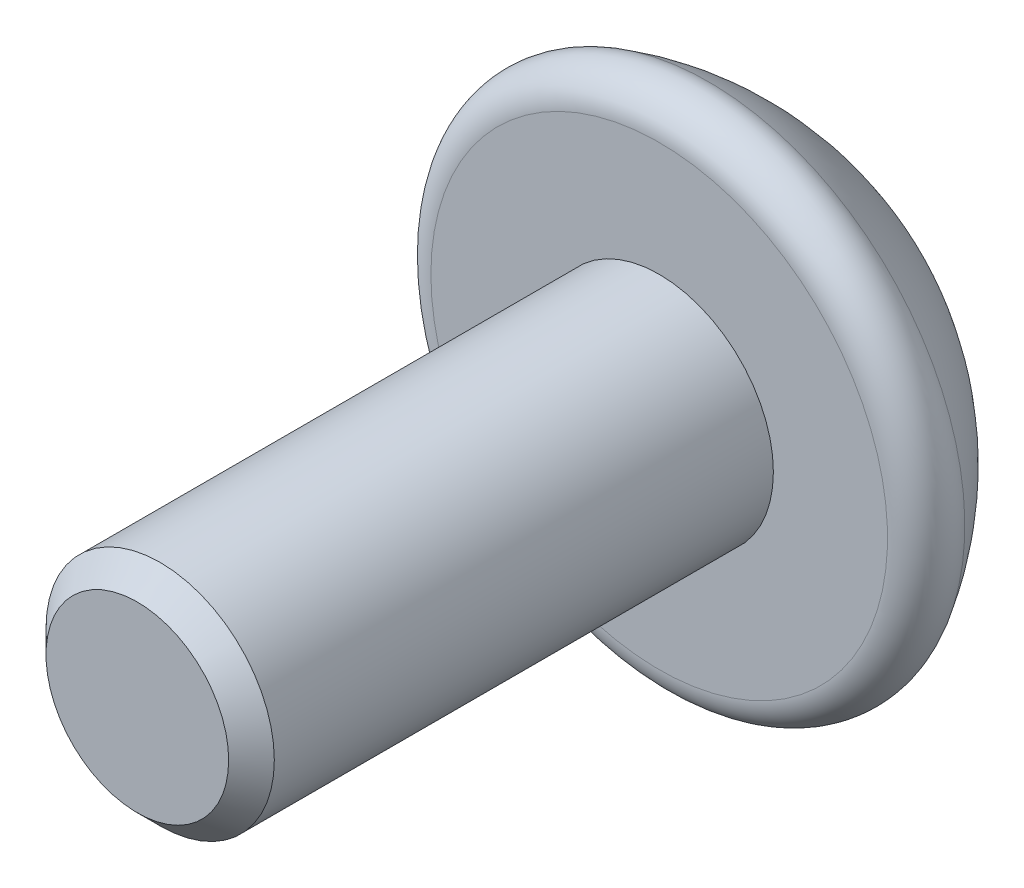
ISO-10303-21;
HEADER;
FILE_DESCRIPTION(('STEP AP214'),'2;1');
FILE_NAME('part.step','',(''),(''),'','','');
FILE_SCHEMA(('AUTOMOTIVE_DESIGN { 1 0 10303 214 1 1 1 1 }'));
ENDSEC;
DATA;
#1=APPLICATION_CONTEXT('core data for automotive mechanical design processes');
#2=APPLICATION_PROTOCOL_DEFINITION('international standard','automotive_design',2000,#1);
#3=PRODUCT_CONTEXT('',#1,'mechanical');
#4=PRODUCT('Part','Part','',(#3));
#5=PRODUCT_RELATED_PRODUCT_CATEGORY('part','',(#4));
#6=PRODUCT_DEFINITION_FORMATION('','',#4);
#7=PRODUCT_DEFINITION_CONTEXT('part definition',#1,'design');
#8=PRODUCT_DEFINITION('design','',#6,#7);
#9=PRODUCT_DEFINITION_SHAPE('','',#8);
#10=(LENGTH_UNIT() NAMED_UNIT(*) SI_UNIT(.MILLI.,.METRE.));
#11=(NAMED_UNIT(*) PLANE_ANGLE_UNIT() SI_UNIT($,.RADIAN.));
#12=(NAMED_UNIT(*) SI_UNIT($,.STERADIAN.) SOLID_ANGLE_UNIT());
#13=UNCERTAINTY_MEASURE_WITH_UNIT(LENGTH_MEASURE(1.E-05),#10,'distance_accuracy_value','');
#14=(GEOMETRIC_REPRESENTATION_CONTEXT(3) GLOBAL_UNCERTAINTY_ASSIGNED_CONTEXT((#13)) GLOBAL_UNIT_ASSIGNED_CONTEXT((#10,
#11,#12)) REPRESENTATION_CONTEXT('',''));
#15=CARTESIAN_POINT('',(0.,0.,0.));
#16=DIRECTION('',(0.,0.,1.));
#17=DIRECTION('',(1.,0.,0.));
#18=AXIS2_PLACEMENT_3D('',#15,#16,#17);
#19=CARTESIAN_POINT('',(0.,0.,1.5625));
#20=DIRECTION('',(0.,0.,-1.));
#21=DIRECTION('',(1.,0.,0.));
#22=AXIS2_PLACEMENT_3D('',#19,#20,#21);
#23=SPHERICAL_SURFACE('',#22,4.5625);
#24=CARTESIAN_POINT('',(0.,0.,-0.753846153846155));
#25=DIRECTION('',(0.,0.,-1.));
#26=DIRECTION('',(-1.,0.,0.));
#27=AXIS2_PLACEMENT_3D('',#24,#25,#26);
#28=CIRCLE('',#27,3.93076923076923);
#29=CARTESIAN_POINT('',(-3.93076923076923,0.,-0.753846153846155));
#30=VERTEX_POINT('',#29);
#31=EDGE_CURVE('E428',#30,#30,#28,.T.);
#32=ORIENTED_EDGE('',*,*,#31,.T.);
#33=EDGE_LOOP('',(#32));
#34=FACE_BOUND('',#33,.T.);
#35=CARTESIAN_POINT('',(-0.6,0.,1.5625));
#36=DIRECTION('',(1.,0.,0.));
#37=DIRECTION('',(0.,1.,0.));
#38=AXIS2_PLACEMENT_3D('',#35,#36,#37);
#39=CIRCLE('',#38,4.52287588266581);
#40=CARTESIAN_POINT('',(-0.6,0.6,-2.92040154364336));
#41=VERTEX_POINT('',#40);
#42=CARTESIAN_POINT('',(-0.6,2.78657495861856,-2.));
#43=VERTEX_POINT('',#42);
#44=EDGE_CURVE('E482',#41,#43,#39,.T.);
#45=ORIENTED_EDGE('',*,*,#44,.F.);
#46=CARTESIAN_POINT('',(0.,0.6,1.5625));
#47=DIRECTION('',(0.,-1.,0.));
#48=DIRECTION('',(1.,0.,0.));
#49=AXIS2_PLACEMENT_3D('',#46,#47,#48);
#50=CIRCLE('',#49,4.52287588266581);
#51=CARTESIAN_POINT('',(-2.78657495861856,0.6,-2.));
#52=VERTEX_POINT('',#51);
#53=EDGE_CURVE('E480',#52,#41,#50,.T.);
#54=ORIENTED_EDGE('',*,*,#53,.F.);
#55=CARTESIAN_POINT('',(0.,0.,-2.));
#56=DIRECTION('',(0.,0.,1.));
#57=DIRECTION('',(1.,0.,0.));
#58=AXIS2_PLACEMENT_3D('',#55,#56,#57);
#59=CIRCLE('',#58,2.85043856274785);
#60=CARTESIAN_POINT('',(-2.78657495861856,-0.6,-2.));
#61=VERTEX_POINT('',#60);
#62=EDGE_CURVE('E479',#52,#61,#59,.T.);
#63=ORIENTED_EDGE('',*,*,#62,.T.);
#64=CARTESIAN_POINT('',(0.,-0.6,1.5625));
#65=DIRECTION('',(0.,1.,0.));
#66=DIRECTION('',(0.,0.,1.));
#67=AXIS2_PLACEMENT_3D('',#64,#65,#66);
#68=CIRCLE('',#67,4.52287588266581);
#69=CARTESIAN_POINT('',(-0.6,-0.6,-2.92040154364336));
#70=VERTEX_POINT('',#69);
#71=EDGE_CURVE('E421',#70,#61,#68,.T.);
#72=ORIENTED_EDGE('',*,*,#71,.F.);
#73=CARTESIAN_POINT('',(-0.6,0.,1.5625));
#74=DIRECTION('',(1.,0.,0.));
#75=DIRECTION('',(0.,1.,0.));
#76=AXIS2_PLACEMENT_3D('',#73,#74,#75);
#77=CIRCLE('',#76,4.52287588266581);
#78=CARTESIAN_POINT('',(-0.6,-2.78657495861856,-2.));
#79=VERTEX_POINT('',#78);
#80=EDGE_CURVE('E374',#79,#70,#77,.T.);
#81=ORIENTED_EDGE('',*,*,#80,.F.);
#82=CARTESIAN_POINT('',(0.6,-2.78657495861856,-2.));
#83=VERTEX_POINT('',#82);
#84=EDGE_CURVE('E434',#79,#83,#59,.T.);
#85=ORIENTED_EDGE('',*,*,#84,.T.);
#86=CARTESIAN_POINT('',(0.6,0.,1.5625));
#87=DIRECTION('',(-1.,0.,0.));
#88=DIRECTION('',(0.,-1.,0.));
#89=AXIS2_PLACEMENT_3D('',#86,#87,#88);
#90=CIRCLE('',#89,4.52287588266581);
#91=CARTESIAN_POINT('',(0.6,-0.6,-2.92040154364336));
#92=VERTEX_POINT('',#91);
#93=EDGE_CURVE('E473',#92,#83,#90,.T.);
#94=ORIENTED_EDGE('',*,*,#93,.F.);
#95=CARTESIAN_POINT('',(0.,-0.6,1.5625));
#96=DIRECTION('',(0.,1.,0.));
#97=DIRECTION('',(0.,0.,1.));
#98=AXIS2_PLACEMENT_3D('',#95,#96,#97);
#99=CIRCLE('',#98,4.52287588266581);
#100=CARTESIAN_POINT('',(2.78657495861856,-0.6,-2.));
#101=VERTEX_POINT('',#100);
#102=EDGE_CURVE('E471',#101,#92,#99,.T.);
#103=ORIENTED_EDGE('',*,*,#102,.F.);
#104=CARTESIAN_POINT('',(2.78657495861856,0.6,-2.));
#105=VERTEX_POINT('',#104);
#106=EDGE_CURVE('E465',#101,#105,#59,.T.);
#107=ORIENTED_EDGE('',*,*,#106,.T.);
#108=CARTESIAN_POINT('',(0.,0.6,1.5625));
#109=DIRECTION('',(0.,-1.,0.));
#110=DIRECTION('',(0.,0.,-1.));
#111=AXIS2_PLACEMENT_3D('',#108,#109,#110);
#112=CIRCLE('',#111,4.52287588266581);
#113=CARTESIAN_POINT('',(0.6,0.6,-2.92040154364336));
#114=VERTEX_POINT('',#113);
#115=EDGE_CURVE('E468',#114,#105,#112,.T.);
#116=ORIENTED_EDGE('',*,*,#115,.F.);
#117=CARTESIAN_POINT('',(0.6,0.,1.5625));
#118=DIRECTION('',(-1.,0.,0.));
#119=DIRECTION('',(0.,-1.,0.));
#120=AXIS2_PLACEMENT_3D('',#117,#118,#119);
#121=CIRCLE('',#120,4.52287588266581);
#122=CARTESIAN_POINT('',(0.6,2.78657495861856,-2.));
#123=VERTEX_POINT('',#122);
#124=EDGE_CURVE('E475',#123,#114,#121,.T.);
#125=ORIENTED_EDGE('',*,*,#124,.F.);
#126=EDGE_CURVE('E469',#123,#43,#59,.T.);
#127=ORIENTED_EDGE('',*,*,#126,.T.);
#128=EDGE_LOOP('',(#45,#54,#63,#72,#81,#85,#94,#103,#107,#116,#125,#127));
#129=FACE_BOUND('',#128,.T.);
#130=ADVANCED_FACE('F351',(#34,#129),#23,.T.);
#131=CARTESIAN_POINT('',(0.,0.,0.));
#132=DIRECTION('',(0.,0.,-1.));
#133=DIRECTION('',(-1.,0.,0.));
#134=AXIS2_PLACEMENT_3D('',#131,#132,#133);
#135=PLANE('',#134);
#136=CARTESIAN_POINT('',(0.,0.,0.));
#137=DIRECTION('',(0.,0.,1.));
#138=DIRECTION('',(1.,0.,0.));
#139=AXIS2_PLACEMENT_3D('',#136,#137,#138);
#140=CIRCLE('',#139,1.75);
#141=CARTESIAN_POINT('',(1.75,0.,0.));
#142=VERTEX_POINT('',#141);
#143=EDGE_CURVE('E425',#142,#142,#140,.T.);
#144=ORIENTED_EDGE('',*,*,#143,.F.);
#145=EDGE_LOOP('',(#144));
#146=FACE_BOUND('',#145,.T.);
#147=CARTESIAN_POINT('',(0.,0.,0.));
#148=DIRECTION('',(0.,0.,-1.));
#149=DIRECTION('',(-1.,0.,0.));
#150=AXIS2_PLACEMENT_3D('',#147,#148,#149);
#151=CIRCLE('',#150,3.5);
#152=CARTESIAN_POINT('',(-3.5,0.,0.));
#153=VERTEX_POINT('',#152);
#154=EDGE_CURVE('E462',#153,#153,#151,.T.);
#155=ORIENTED_EDGE('',*,*,#154,.F.);
#156=EDGE_LOOP('',(#155));
#157=FACE_BOUND('',#156,.T.);
#158=ADVANCED_FACE('F353',(#146,#157),#135,.F.);
#159=CARTESIAN_POINT('',(0.,0.,-0.5));
#160=DIRECTION('',(0.,0.,-1.));
#161=DIRECTION('',(-1.,0.,0.));
#162=AXIS2_PLACEMENT_3D('',#159,#160,#161);
#163=TOROIDAL_SURFACE('',#162,3.5,0.500000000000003);
#164=ORIENTED_EDGE('',*,*,#31,.F.);
#165=EDGE_LOOP('',(#164));
#166=FACE_BOUND('',#165,.T.);
#167=ORIENTED_EDGE('',*,*,#154,.T.);
#168=EDGE_LOOP('',(#167));
#169=FACE_BOUND('',#168,.T.);
#170=ADVANCED_FACE('F507',(#166,#169),#163,.T.);
#171=CARTESIAN_POINT('',(-3.5,-0.6,-2.));
#172=DIRECTION('',(0.,1.,0.));
#173=DIRECTION('',(0.,0.,1.));
#174=AXIS2_PLACEMENT_3D('',#171,#172,#173);
#175=PLANE('',#174);
#176=ORIENTED_EDGE('',*,*,#71,.T.);
#177=DIRECTION('',(1.,0.,0.));
#178=VECTOR('',#177,1.);
#179=CARTESIAN_POINT('',(-3.5,-0.6,-2.));
#180=LINE('',#179,#178);
#181=CARTESIAN_POINT('',(-0.6,-0.6,-2.));
#182=VERTEX_POINT('',#181);
#183=EDGE_CURVE('E417',#61,#182,#180,.T.);
#184=ORIENTED_EDGE('',*,*,#183,.T.);
#185=DIRECTION('',(0.,0.,-1.));
#186=VECTOR('',#185,1.);
#187=CARTESIAN_POINT('',(-0.6,-0.6,-2.));
#188=LINE('',#187,#186);
#189=EDGE_CURVE('E419',#182,#70,#188,.T.);
#190=ORIENTED_EDGE('',*,*,#189,.T.);
#191=EDGE_LOOP('',(#176,#184,#190));
#192=FACE_BOUND('',#191,.T.);
#193=ADVANCED_FACE('F418',(#192),#175,.T.);
#194=CARTESIAN_POINT('',(-0.6,-0.6,-2.));
#195=DIRECTION('',(1.,0.,0.));
#196=DIRECTION('',(0.,1.,0.));
#197=AXIS2_PLACEMENT_3D('',#194,#195,#196);
#198=PLANE('',#197);
#199=ORIENTED_EDGE('',*,*,#80,.T.);
#200=ORIENTED_EDGE('',*,*,#189,.F.);
#201=DIRECTION('',(0.,-1.,0.));
#202=VECTOR('',#201,1.);
#203=CARTESIAN_POINT('',(-0.6,-0.6,-2.));
#204=LINE('',#203,#202);
#205=EDGE_CURVE('E424',#182,#79,#204,.T.);
#206=ORIENTED_EDGE('',*,*,#205,.T.);
#207=EDGE_LOOP('',(#199,#200,#206));
#208=FACE_BOUND('',#207,.T.);
#209=ADVANCED_FACE('F427',(#208),#198,.T.);
#210=CARTESIAN_POINT('',(0.6,-0.6,-2.));
#211=DIRECTION('',(-1.,0.,0.));
#212=DIRECTION('',(0.,-1.,0.));
#213=AXIS2_PLACEMENT_3D('',#210,#211,#212);
#214=PLANE('',#213);
#215=ORIENTED_EDGE('',*,*,#93,.T.);
#216=DIRECTION('',(0.,1.,0.));
#217=VECTOR('',#216,1.);
#218=CARTESIAN_POINT('',(0.6,-0.6,-2.));
#219=LINE('',#218,#217);
#220=CARTESIAN_POINT('',(0.6,-0.6,-2.));
#221=VERTEX_POINT('',#220);
#222=EDGE_CURVE('E435',#83,#221,#219,.T.);
#223=ORIENTED_EDGE('',*,*,#222,.T.);
#224=DIRECTION('',(0.,0.,-1.));
#225=VECTOR('',#224,1.);
#226=CARTESIAN_POINT('',(0.6,-0.6,-2.));
#227=LINE('',#226,#225);
#228=EDGE_CURVE('E429',#221,#92,#227,.T.);
#229=ORIENTED_EDGE('',*,*,#228,.T.);
#230=EDGE_LOOP('',(#215,#223,#229));
#231=FACE_BOUND('',#230,.T.);
#232=ADVANCED_FACE('F522',(#231),#214,.T.);
#233=CARTESIAN_POINT('',(0.6,-0.6,-2.));
#234=DIRECTION('',(0.,1.,0.));
#235=DIRECTION('',(0.,0.,1.));
#236=AXIS2_PLACEMENT_3D('',#233,#234,#235);
#237=PLANE('',#236);
#238=ORIENTED_EDGE('',*,*,#102,.T.);
#239=ORIENTED_EDGE('',*,*,#228,.F.);
#240=DIRECTION('',(1.,0.,0.));
#241=VECTOR('',#240,1.);
#242=CARTESIAN_POINT('',(0.6,-0.6,-2.));
#243=LINE('',#242,#241);
#244=EDGE_CURVE('E437',#221,#101,#243,.T.);
#245=ORIENTED_EDGE('',*,*,#244,.T.);
#246=EDGE_LOOP('',(#238,#239,#245));
#247=FACE_BOUND('',#246,.T.);
#248=ADVANCED_FACE('F526',(#247),#237,.T.);
#249=CARTESIAN_POINT('',(0.6,0.6,-2.));
#250=DIRECTION('',(0.,-1.,0.));
#251=DIRECTION('',(0.,0.,-1.));
#252=AXIS2_PLACEMENT_3D('',#249,#250,#251);
#253=PLANE('',#252);
#254=ORIENTED_EDGE('',*,*,#115,.T.);
#255=DIRECTION('',(-1.,0.,0.));
#256=VECTOR('',#255,1.);
#257=CARTESIAN_POINT('',(0.6,0.6,-2.));
#258=LINE('',#257,#256);
#259=CARTESIAN_POINT('',(0.6,0.6,-2.));
#260=VERTEX_POINT('',#259);
#261=EDGE_CURVE('E366',#105,#260,#258,.T.);
#262=ORIENTED_EDGE('',*,*,#261,.T.);
#263=DIRECTION('',(0.,0.,-1.));
#264=VECTOR('',#263,1.);
#265=CARTESIAN_POINT('',(0.6,0.6,-2.));
#266=LINE('',#265,#264);
#267=EDGE_CURVE('E455',#260,#114,#266,.T.);
#268=ORIENTED_EDGE('',*,*,#267,.T.);
#269=EDGE_LOOP('',(#254,#262,#268));
#270=FACE_BOUND('',#269,.T.);
#271=ADVANCED_FACE('F532',(#270),#253,.T.);
#272=CARTESIAN_POINT('',(0.6,3.5,-2.));
#273=DIRECTION('',(-1.,0.,0.));
#274=DIRECTION('',(0.,-1.,0.));
#275=AXIS2_PLACEMENT_3D('',#272,#273,#274);
#276=PLANE('',#275);
#277=ORIENTED_EDGE('',*,*,#124,.T.);
#278=ORIENTED_EDGE('',*,*,#267,.F.);
#279=DIRECTION('',(0.,1.,0.));
#280=VECTOR('',#279,1.);
#281=CARTESIAN_POINT('',(0.6,3.5,-2.));
#282=LINE('',#281,#280);
#283=EDGE_CURVE('E444',#260,#123,#282,.T.);
#284=ORIENTED_EDGE('',*,*,#283,.T.);
#285=EDGE_LOOP('',(#277,#278,#284));
#286=FACE_BOUND('',#285,.T.);
#287=ADVANCED_FACE('F536',(#286),#276,.T.);
#288=CARTESIAN_POINT('',(-0.6,3.5,-2.));
#289=DIRECTION('',(1.,0.,0.));
#290=DIRECTION('',(0.,1.,0.));
#291=AXIS2_PLACEMENT_3D('',#288,#289,#290);
#292=PLANE('',#291);
#293=ORIENTED_EDGE('',*,*,#44,.T.);
#294=DIRECTION('',(0.,-1.,0.));
#295=VECTOR('',#294,1.);
#296=CARTESIAN_POINT('',(-0.6,3.5,-2.));
#297=LINE('',#296,#295);
#298=CARTESIAN_POINT('',(-0.6,0.6,-2.));
#299=VERTEX_POINT('',#298);
#300=EDGE_CURVE('E447',#43,#299,#297,.T.);
#301=ORIENTED_EDGE('',*,*,#300,.T.);
#302=DIRECTION('',(0.,0.,-1.));
#303=VECTOR('',#302,1.);
#304=CARTESIAN_POINT('',(-0.6,0.6,-2.));
#305=LINE('',#304,#303);
#306=EDGE_CURVE('E452',#299,#41,#305,.T.);
#307=ORIENTED_EDGE('',*,*,#306,.T.);
#308=EDGE_LOOP('',(#293,#301,#307));
#309=FACE_BOUND('',#308,.T.);
#310=ADVANCED_FACE('F540',(#309),#292,.T.);
#311=CARTESIAN_POINT('',(-3.5,0.6,-2.));
#312=DIRECTION('',(0.,-1.,0.));
#313=DIRECTION('',(1.,0.,0.));
#314=AXIS2_PLACEMENT_3D('',#311,#312,#313);
#315=PLANE('',#314);
#316=ORIENTED_EDGE('',*,*,#53,.T.);
#317=ORIENTED_EDGE('',*,*,#306,.F.);
#318=DIRECTION('',(-1.,0.,0.));
#319=VECTOR('',#318,1.);
#320=CARTESIAN_POINT('',(-3.5,0.6,-2.));
#321=LINE('',#320,#319);
#322=EDGE_CURVE('E449',#299,#52,#321,.T.);
#323=ORIENTED_EDGE('',*,*,#322,.T.);
#324=EDGE_LOOP('',(#316,#317,#323));
#325=FACE_BOUND('',#324,.T.);
#326=ADVANCED_FACE('F544',(#325),#315,.T.);
#327=CARTESIAN_POINT('',(-3.5,-0.6,-2.));
#328=DIRECTION('',(0.,0.,1.));
#329=DIRECTION('',(1.,0.,0.));
#330=AXIS2_PLACEMENT_3D('',#327,#328,#329);
#331=PLANE('',#330);
#332=ORIENTED_EDGE('',*,*,#283,.F.);
#333=ORIENTED_EDGE('',*,*,#261,.F.);
#334=ORIENTED_EDGE('',*,*,#106,.F.);
#335=ORIENTED_EDGE('',*,*,#244,.F.);
#336=ORIENTED_EDGE('',*,*,#222,.F.);
#337=ORIENTED_EDGE('',*,*,#84,.F.);
#338=ORIENTED_EDGE('',*,*,#205,.F.);
#339=ORIENTED_EDGE('',*,*,#183,.F.);
#340=ORIENTED_EDGE('',*,*,#62,.F.);
#341=ORIENTED_EDGE('',*,*,#322,.F.);
#342=ORIENTED_EDGE('',*,*,#300,.F.);
#343=ORIENTED_EDGE('',*,*,#126,.F.);
#344=EDGE_LOOP('',(#332,#333,#334,#335,#336,#337,#338,#339,#340,#341,#342,#343));
#345=FACE_BOUND('',#344,.T.);
#346=ADVANCED_FACE('F431',(#345),#331,.F.);
#347=CARTESIAN_POINT('',(0.,0.,8.));
#348=DIRECTION('',(0.,0.,1.));
#349=DIRECTION('',(1.,0.,0.));
#350=AXIS2_PLACEMENT_3D('',#347,#348,#349);
#351=PLANE('',#350);
#352=CARTESIAN_POINT('',(0.,0.,8.));
#353=DIRECTION('',(0.,0.,1.));
#354=DIRECTION('',(1.,0.,0.));
#355=AXIS2_PLACEMENT_3D('',#352,#353,#354);
#356=CIRCLE('',#355,1.4);
#357=CARTESIAN_POINT('',(1.4,0.,8.));
#358=VERTEX_POINT('',#357);
#359=EDGE_CURVE('E359',#358,#358,#356,.T.);
#360=ORIENTED_EDGE('',*,*,#359,.T.);
#361=EDGE_LOOP('',(#360));
#362=FACE_BOUND('',#361,.T.);
#363=ADVANCED_FACE('F486',(#362),#351,.T.);
#364=CARTESIAN_POINT('',(0.,0.,0.));
#365=DIRECTION('',(0.,0.,1.));
#366=DIRECTION('',(1.,0.,0.));
#367=AXIS2_PLACEMENT_3D('',#364,#365,#366);
#368=CYLINDRICAL_SURFACE('',#367,1.75);
#369=CARTESIAN_POINT('',(0.,0.,7.65));
#370=DIRECTION('',(0.,0.,1.));
#371=DIRECTION('',(1.,0.,0.));
#372=AXIS2_PLACEMENT_3D('',#369,#370,#371);
#373=CIRCLE('',#372,1.75);
#374=CARTESIAN_POINT('',(1.75,0.,7.65));
#375=VERTEX_POINT('',#374);
#376=EDGE_CURVE('E11',#375,#375,#373,.F.);
#377=ORIENTED_EDGE('',*,*,#376,.T.);
#378=EDGE_LOOP('',(#377));
#379=FACE_BOUND('',#378,.T.);
#380=ORIENTED_EDGE('',*,*,#143,.T.);
#381=EDGE_LOOP('',(#380));
#382=FACE_BOUND('',#381,.T.);
#383=ADVANCED_FACE('F490',(#379,#382),#368,.T.);
#384=CARTESIAN_POINT('',(0.,0.,8.));
#385=DIRECTION('',(0.,0.,-1.));
#386=DIRECTION('',(-1.,0.,0.));
#387=AXIS2_PLACEMENT_3D('',#384,#385,#386);
#388=CONICAL_SURFACE('',#387,1.4,0.785398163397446);
#389=ORIENTED_EDGE('',*,*,#376,.F.);
#390=EDGE_LOOP('',(#389));
#391=FACE_BOUND('',#390,.T.);
#392=ORIENTED_EDGE('',*,*,#359,.F.);
#393=EDGE_LOOP('',(#392));
#394=FACE_BOUND('',#393,.T.);
#395=ADVANCED_FACE('F488',(#391,#394),#388,.T.);
#396=CLOSED_SHELL('',(#130,#158,#170,#193,#209,#232,#248,#271,#287,#310,#326,#346,#363,#383,#395));
#397=MANIFOLD_SOLID_BREP('B2',#396);
#398=ADVANCED_BREP_SHAPE_REPRESENTATION('',(#18,#397),#14);
#399=SHAPE_DEFINITION_REPRESENTATION(#9,#398);
ENDSEC;
END-ISO-10303-21;
